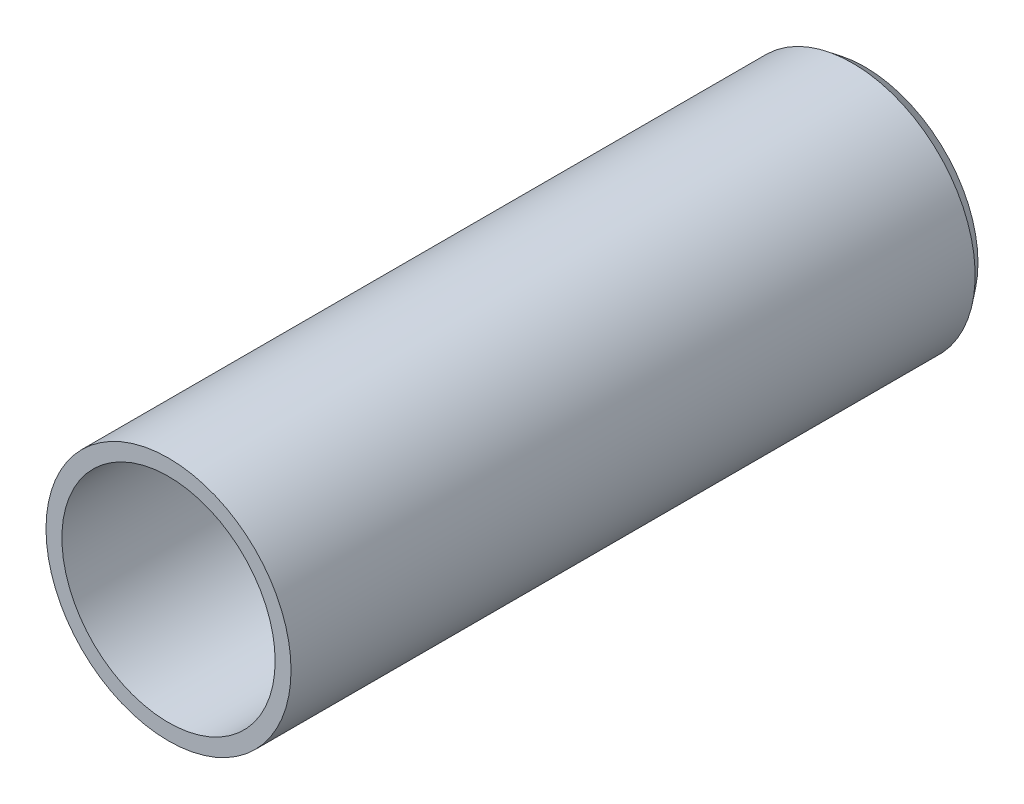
from build123d import *

# Parameters (mm, degrees)
SKETCH1_R      = 30.1625
SKETCH1_R_2    = 26.2509
EXTRUDE1_DEPTH = 171.45


with BuildPart() as part:
    # Sketch1 → Extrude1 (new body)
    with BuildSketch(Plane.XY):
        Circle(SKETCH1_R)
        Circle(SKETCH1_R_2, mode=Mode.SUBTRACT)
    extrude(amount=EXTRUDE1_DEPTH)

    # Sketch5 → Cut-Revolve1 (revolve, cut)
    with BuildSketch(Plane(origin=(0, 0, 0), x_dir=(0, 0, -1), z_dir=(1, 0, 0)), mode=Mode.PRIVATE) as cut_revolve1_sk:
        Polygon((-3.028826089, -30.1625), (0, -27.8384), (0, -30.1625), align=None)
    revolve(cut_revolve1_sk.sketch.rotate(Axis((0, 0, -5.290311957), (0, 0, 1)), 270), axis=Axis((0, 0, -5.290311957), (0, 0, 1)), mode=Mode.SUBTRACT)


solid = part.part
